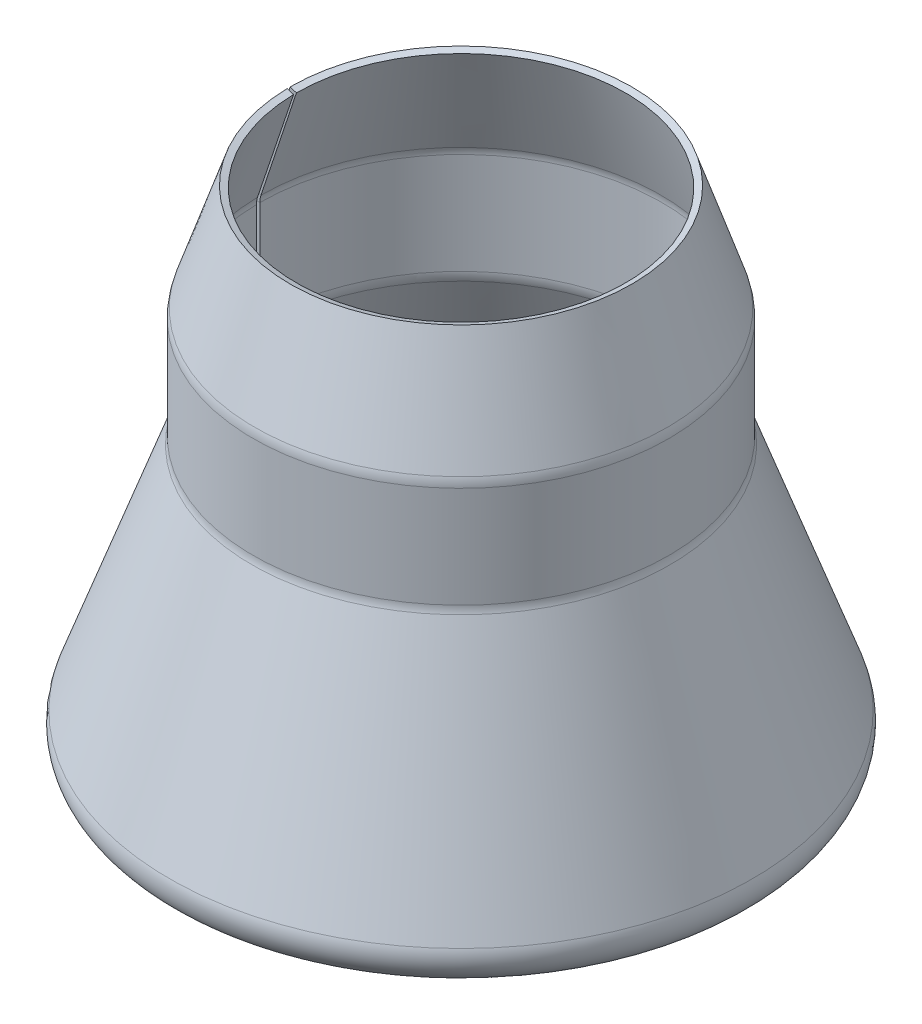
ISO-10303-21;
HEADER;
FILE_DESCRIPTION(('STEP AP214'),'2;1');
FILE_NAME('part.step','',(''),(''),'','','');
FILE_SCHEMA(('AUTOMOTIVE_DESIGN { 1 0 10303 214 1 1 1 1 }'));
ENDSEC;
DATA;
#1=APPLICATION_CONTEXT('core data for automotive mechanical design processes');
#2=APPLICATION_PROTOCOL_DEFINITION('international standard','automotive_design',2000,#1);
#3=PRODUCT_CONTEXT('',#1,'mechanical');
#4=PRODUCT('Part','Part','',(#3));
#5=PRODUCT_RELATED_PRODUCT_CATEGORY('part','',(#4));
#6=PRODUCT_DEFINITION_FORMATION('','',#4);
#7=PRODUCT_DEFINITION_CONTEXT('part definition',#1,'design');
#8=PRODUCT_DEFINITION('design','',#6,#7);
#9=PRODUCT_DEFINITION_SHAPE('','',#8);
#10=(LENGTH_UNIT() NAMED_UNIT(*) SI_UNIT(.MILLI.,.METRE.));
#11=(NAMED_UNIT(*) PLANE_ANGLE_UNIT() SI_UNIT($,.RADIAN.));
#12=(NAMED_UNIT(*) SI_UNIT($,.STERADIAN.) SOLID_ANGLE_UNIT());
#13=UNCERTAINTY_MEASURE_WITH_UNIT(LENGTH_MEASURE(1.E-05),#10,'distance_accuracy_value','');
#14=(GEOMETRIC_REPRESENTATION_CONTEXT(3) GLOBAL_UNCERTAINTY_ASSIGNED_CONTEXT((#13)) GLOBAL_UNIT_ASSIGNED_CONTEXT((#10,
#11,#12)) REPRESENTATION_CONTEXT('',''));
#15=CARTESIAN_POINT('',(0.,0.,0.));
#16=DIRECTION('',(0.,0.,1.));
#17=DIRECTION('',(1.,0.,0.));
#18=AXIS2_PLACEMENT_3D('',#15,#16,#17);
#19=CARTESIAN_POINT('',(-24.4962685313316,49.5131670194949,0.427583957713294));
#20=DIRECTION('',(-0.0174524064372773,0.,-0.999847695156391));
#21=DIRECTION('',(-0.999847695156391,0.,0.0174524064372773));
#22=AXIS2_PLACEMENT_3D('',#19,#20,#21);
#23=PLANE('',#22);
#24=DIRECTION('',(-0.94853880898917,0.316227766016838,0.0165568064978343));
#25=VECTOR('',#24,1.);
#26=CARTESIAN_POINT('',(-27.3418849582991,50.4618503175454,0.477254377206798));
#27=LINE('',#26,#25);
#28=CARTESIAN_POINT('',(-27.3418849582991,50.4618503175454,0.477254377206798));
#29=VERTEX_POINT('',#28);
#30=CARTESIAN_POINT('',(-28.1955698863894,50.7464553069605,0.492155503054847));
#31=VERTEX_POINT('',#30);
#32=EDGE_CURVE('E12',#29,#31,#27,.T.);
#33=ORIENTED_EDGE('',*,*,#32,.F.);
#34=CARTESIAN_POINT('',(-24.4962685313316,49.5131670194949,0.427583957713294));
#35=DIRECTION('',(0.0174524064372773,0.,0.999847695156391));
#36=DIRECTION('',(0.999847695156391,0.,-0.0174524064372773));
#37=AXIS2_PLACEMENT_3D('',#34,#35,#36);
#38=CIRCLE('',#37,3.);
#39=CARTESIAN_POINT('',(-27.4958116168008,49.5131670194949,0.479941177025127));
#40=VERTEX_POINT('',#39);
#41=EDGE_CURVE('E155',#40,#29,#38,.F.);
#42=ORIENTED_EDGE('',*,*,#41,.F.);
#43=DIRECTION('',(-0.999847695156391,0.,0.0174524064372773));
#44=VECTOR('',#43,1.);
#45=CARTESIAN_POINT('',(-27.4958116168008,49.5131670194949,0.479941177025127));
#46=LINE('',#45,#44);
#47=CARTESIAN_POINT('',(-28.3956745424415,49.5131670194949,0.495648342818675));
#48=VERTEX_POINT('',#47);
#49=EDGE_CURVE('E75',#40,#48,#46,.T.);
#50=ORIENTED_EDGE('',*,*,#49,.T.);
#51=CARTESIAN_POINT('',(-24.4962685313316,49.5131670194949,0.427583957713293));
#52=DIRECTION('',(0.0174524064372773,0.,0.999847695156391));
#53=DIRECTION('',(0.999847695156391,0.,-0.0174524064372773));
#54=AXIS2_PLACEMENT_3D('',#51,#52,#53);
#55=CIRCLE('',#54,3.9);
#56=EDGE_CURVE('E152',#48,#31,#55,.F.);
#57=ORIENTED_EDGE('',*,*,#56,.T.);
#58=EDGE_LOOP('',(#33,#42,#50,#57));
#59=FACE_BOUND('',#58,.T.);
#60=ADVANCED_FACE('F66',(#59),#23,.T.);
#61=CARTESIAN_POINT('',(-27.4958116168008,42.5943503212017,0.479941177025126));
#62=DIRECTION('',(0.0174524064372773,0.,0.999847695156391));
#63=DIRECTION('',(0.,1.,0.));
#64=AXIS2_PLACEMENT_3D('',#61,#62,#63);
#65=PLANE('',#64);
#66=ORIENTED_EDGE('',*,*,#49,.F.);
#67=DIRECTION('',(0.,1.,0.));
#68=VECTOR('',#67,1.);
#69=CARTESIAN_POINT('',(-27.4958116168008,35.,0.479941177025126));
#70=LINE('',#69,#68);
#71=CARTESIAN_POINT('',(-27.4958116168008,35.6755336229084,0.479941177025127));
#72=VERTEX_POINT('',#71);
#73=EDGE_CURVE('E231',#72,#40,#70,.T.);
#74=ORIENTED_EDGE('',*,*,#73,.F.);
#75=DIRECTION('',(-0.999847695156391,0.,0.0174524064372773));
#76=VECTOR('',#75,1.);
#77=CARTESIAN_POINT('',(-27.4958116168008,35.6755336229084,0.479941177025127));
#78=LINE('',#77,#76);
#79=CARTESIAN_POINT('',(-28.3956745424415,35.6755336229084,0.495648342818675));
#80=VERTEX_POINT('',#79);
#81=EDGE_CURVE('E160',#72,#80,#78,.T.);
#82=ORIENTED_EDGE('',*,*,#81,.T.);
#83=DIRECTION('',(0.,-1.,0.));
#84=VECTOR('',#83,1.);
#85=CARTESIAN_POINT('',(-28.3956745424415,0.,0.495648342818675));
#86=LINE('',#85,#84);
#87=EDGE_CURVE('E172',#80,#48,#86,.F.);
#88=ORIENTED_EDGE('',*,*,#87,.T.);
#89=EDGE_LOOP('',(#66,#74,#82,#88));
#90=FACE_BOUND('',#89,.T.);
#91=ADVANCED_FACE('F173',(#90),#65,.F.);
#92=CARTESIAN_POINT('',(-31.3952176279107,35.6755336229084,0.548005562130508));
#93=DIRECTION('',(0.0174524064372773,0.,0.999847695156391));
#94=DIRECTION('',(0.999847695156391,0.,-0.0174524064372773));
#95=AXIS2_PLACEMENT_3D('',#92,#93,#94);
#96=PLANE('',#95);
#97=ORIENTED_EDGE('',*,*,#81,.F.);
#98=CARTESIAN_POINT('',(-31.3952176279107,35.6755336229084,0.548005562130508));
#99=DIRECTION('',(-0.0174524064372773,0.,-0.999847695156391));
#100=DIRECTION('',(-0.999847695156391,0.,0.0174524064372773));
#101=AXIS2_PLACEMENT_3D('',#98,#99,#100);
#102=CIRCLE('',#101,3.9);
#103=CARTESIAN_POINT('',(-27.7229835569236,34.3638216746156,0.483906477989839));
#104=VERTEX_POINT('',#103);
#105=EDGE_CURVE('E222',#104,#72,#102,.F.);
#106=ORIENTED_EDGE('',*,*,#105,.F.);
#107=DIRECTION('',(-0.941598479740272,0.336336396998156,0.0164356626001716));
#108=VECTOR('',#107,1.);
#109=CARTESIAN_POINT('',(-27.7229835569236,34.3638216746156,0.483906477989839));
#110=LINE('',#109,#108);
#111=CARTESIAN_POINT('',(-28.5704221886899,34.666524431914,0.498698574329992));
#112=VERTEX_POINT('',#111);
#113=EDGE_CURVE('E263',#104,#112,#110,.T.);
#114=ORIENTED_EDGE('',*,*,#113,.T.);
#115=CARTESIAN_POINT('',(-31.3952176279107,35.6755336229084,0.548005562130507));
#116=DIRECTION('',(0.0174524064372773,0.,0.999847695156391));
#117=DIRECTION('',(0.999847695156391,0.,-0.0174524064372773));
#118=AXIS2_PLACEMENT_3D('',#115,#116,#117);
#119=CIRCLE('',#118,3.);
#120=EDGE_CURVE('E190',#112,#80,#119,.T.);
#121=ORIENTED_EDGE('',*,*,#120,.T.);
#122=EDGE_LOOP('',(#97,#106,#114,#121));
#123=FACE_BOUND('',#122,.T.);
#124=ADVANCED_FACE('F270',(#123),#96,.F.);
#125=CARTESIAN_POINT('',(-27.4958116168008,35.,0.479941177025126));
#126=DIRECTION('',(0.0174524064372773,0.,0.999847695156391));
#127=DIRECTION('',(0.336285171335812,0.941741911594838,-0.00586987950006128));
#128=AXIS2_PLACEMENT_3D('',#125,#126,#127);
#129=PLANE('',#128);
#130=DIRECTION('',(-0.336285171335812,-0.941741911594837,0.00586987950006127));
#131=VECTOR('',#130,1.);
#132=CARTESIAN_POINT('',(-40.8413464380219,0.302702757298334,0.712888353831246));
#133=LINE('',#132,#131);
#134=CARTESIAN_POINT('',(-39.8324909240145,3.12792849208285,0.695278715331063));
#135=VERTEX_POINT('',#134);
#136=EDGE_CURVE('E193',#135,#112,#133,.F.);
#137=ORIENTED_EDGE('',*,*,#136,.T.);
#138=ORIENTED_EDGE('',*,*,#113,.F.);
#139=DIRECTION('',(0.336285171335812,0.941741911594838,-0.00586987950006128));
#140=VECTOR('',#139,1.);
#141=CARTESIAN_POINT('',(-27.4958116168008,35.,0.479941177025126));
#142=LINE('',#141,#140);
#143=CARTESIAN_POINT('',(-38.9850522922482,2.82522573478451,0.680486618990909));
#144=VERTEX_POINT('',#143);
#145=EDGE_CURVE('E216',#144,#104,#142,.T.);
#146=ORIENTED_EDGE('',*,*,#145,.F.);
#147=DIRECTION('',(0.941598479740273,-0.336336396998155,-0.0164356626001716));
#148=VECTOR('',#147,1.);
#149=CARTESIAN_POINT('',(-38.9850522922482,2.82522573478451,0.68048661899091));
#150=LINE('',#149,#148);
#151=EDGE_CURVE('E300',#135,#144,#150,.T.);
#152=ORIENTED_EDGE('',*,*,#151,.F.);
#153=EDGE_LOOP('',(#137,#138,#146,#152));
#154=FACE_BOUND('',#153,.T.);
#155=ADVANCED_FACE('F407',(#154),#129,.F.);
#156=CARTESIAN_POINT('',(-27.5,35.,0.));
#157=DIRECTION('',(0.,0.,1.));
#158=DIRECTION('',(0.336336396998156,0.941741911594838,0.));
#159=AXIS2_PLACEMENT_3D('',#156,#157,#158);
#160=PLANE('',#159);
#161=DIRECTION('',(-0.941741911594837,0.336336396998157,0.));
#162=VECTOR('',#161,1.);
#163=CARTESIAN_POINT('',(-27.7272065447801,34.3638216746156,0.));
#164=LINE('',#163,#162);
#165=CARTESIAN_POINT('',(-27.7272065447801,34.3638216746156,0.));
#166=VERTEX_POINT('',#165);
#167=CARTESIAN_POINT('',(-28.5747742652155,34.666524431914,0.));
#168=VERTEX_POINT('',#167);
#169=EDGE_CURVE('E261',#166,#168,#164,.T.);
#170=ORIENTED_EDGE('',*,*,#169,.T.);
#171=DIRECTION('',(-0.336336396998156,-0.941741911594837,0.));
#172=VECTOR('',#171,1.);
#173=CARTESIAN_POINT('',(-40.8475677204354,0.302702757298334,0.));
#174=LINE('',#173,#172);
#175=CARTESIAN_POINT('',(-39.8385585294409,3.12792849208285,0.));
#176=VERTEX_POINT('',#175);
#177=EDGE_CURVE('E134',#176,#168,#174,.F.);
#178=ORIENTED_EDGE('',*,*,#177,.F.);
#179=DIRECTION('',(0.941741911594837,-0.336336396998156,0.));
#180=VECTOR('',#179,1.);
#181=CARTESIAN_POINT('',(-38.9909908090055,2.82522573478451,0.));
#182=LINE('',#181,#180);
#183=CARTESIAN_POINT('',(-38.9909908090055,2.82522573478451,0.));
#184=VERTEX_POINT('',#183);
#185=EDGE_CURVE('E320',#176,#184,#182,.T.);
#186=ORIENTED_EDGE('',*,*,#185,.T.);
#187=DIRECTION('',(0.336336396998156,0.941741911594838,0.));
#188=VECTOR('',#187,1.);
#189=CARTESIAN_POINT('',(-27.5,35.,0.));
#190=LINE('',#189,#188);
#191=EDGE_CURVE('E212',#184,#166,#190,.T.);
#192=ORIENTED_EDGE('',*,*,#191,.T.);
#193=EDGE_LOOP('',(#170,#178,#186,#192));
#194=FACE_BOUND('',#193,.T.);
#195=ADVANCED_FACE('F410',(#194),#160,.T.);
#196=CARTESIAN_POINT('',(-31.4,35.6755336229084,0.));
#197=DIRECTION('',(0.,0.,1.));
#198=DIRECTION('',(1.,0.,0.));
#199=AXIS2_PLACEMENT_3D('',#196,#197,#198);
#200=PLANE('',#199);
#201=ORIENTED_EDGE('',*,*,#169,.F.);
#202=CARTESIAN_POINT('',(-31.4,35.6755336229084,0.));
#203=DIRECTION('',(0.,0.,-1.));
#204=DIRECTION('',(-1.,0.,0.));
#205=AXIS2_PLACEMENT_3D('',#202,#203,#204);
#206=CIRCLE('',#205,3.9);
#207=CARTESIAN_POINT('',(-27.5,35.6755336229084,0.));
#208=VERTEX_POINT('',#207);
#209=EDGE_CURVE('E214',#166,#208,#206,.F.);
#210=ORIENTED_EDGE('',*,*,#209,.T.);
#211=DIRECTION('',(-1.,0.,0.));
#212=VECTOR('',#211,1.);
#213=CARTESIAN_POINT('',(-27.5,35.6755336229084,0.));
#214=LINE('',#213,#212);
#215=CARTESIAN_POINT('',(-28.4,35.6755336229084,0.));
#216=VERTEX_POINT('',#215);
#217=EDGE_CURVE('E259',#208,#216,#214,.T.);
#218=ORIENTED_EDGE('',*,*,#217,.T.);
#219=CARTESIAN_POINT('',(-31.4,35.6755336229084,0.));
#220=DIRECTION('',(0.,0.,1.));
#221=DIRECTION('',(1.,0.,0.));
#222=AXIS2_PLACEMENT_3D('',#219,#220,#221);
#223=CIRCLE('',#222,3.);
#224=EDGE_CURVE('E204',#168,#216,#223,.T.);
#225=ORIENTED_EDGE('',*,*,#224,.F.);
#226=EDGE_LOOP('',(#201,#210,#218,#225));
#227=FACE_BOUND('',#226,.T.);
#228=ADVANCED_FACE('F413',(#227),#200,.T.);
#229=CARTESIAN_POINT('',(-27.5,42.5943503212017,0.));
#230=DIRECTION('',(0.,0.,1.));
#231=DIRECTION('',(0.,1.,0.));
#232=AXIS2_PLACEMENT_3D('',#229,#230,#231);
#233=PLANE('',#232);
#234=ORIENTED_EDGE('',*,*,#217,.F.);
#235=DIRECTION('',(0.,1.,0.));
#236=VECTOR('',#235,1.);
#237=CARTESIAN_POINT('',(-27.5,35.,0.));
#238=LINE('',#237,#236);
#239=CARTESIAN_POINT('',(-27.5,49.5131670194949,0.));
#240=VERTEX_POINT('',#239);
#241=EDGE_CURVE('E225',#208,#240,#238,.T.);
#242=ORIENTED_EDGE('',*,*,#241,.T.);
#243=DIRECTION('',(-1.,0.,0.));
#244=VECTOR('',#243,1.);
#245=CARTESIAN_POINT('',(-27.5,49.5131670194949,0.));
#246=LINE('',#245,#244);
#247=CARTESIAN_POINT('',(-28.4,49.5131670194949,0.));
#248=VERTEX_POINT('',#247);
#249=EDGE_CURVE('E256',#240,#248,#246,.T.);
#250=ORIENTED_EDGE('',*,*,#249,.T.);
#251=DIRECTION('',(0.,-1.,0.));
#252=VECTOR('',#251,1.);
#253=CARTESIAN_POINT('',(-28.4,0.,0.));
#254=LINE('',#253,#252);
#255=EDGE_CURVE('E182',#216,#248,#254,.F.);
#256=ORIENTED_EDGE('',*,*,#255,.F.);
#257=EDGE_LOOP('',(#234,#242,#250,#256));
#258=FACE_BOUND('',#257,.T.);
#259=ADVANCED_FACE('F369',(#258),#233,.T.);
#260=CARTESIAN_POINT('',(-24.5,49.5131670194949,0.));
#261=DIRECTION('',(0.,0.,-1.));
#262=DIRECTION('',(-1.,0.,0.));
#263=AXIS2_PLACEMENT_3D('',#260,#261,#262);
#264=PLANE('',#263);
#265=ORIENTED_EDGE('',*,*,#249,.F.);
#266=CARTESIAN_POINT('',(-24.5,49.5131670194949,0.));
#267=DIRECTION('',(0.,0.,1.));
#268=DIRECTION('',(1.,0.,0.));
#269=AXIS2_PLACEMENT_3D('',#266,#267,#268);
#270=CIRCLE('',#269,3.);
#271=CARTESIAN_POINT('',(-27.3460498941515,50.4618503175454,0.));
#272=VERTEX_POINT('',#271);
#273=EDGE_CURVE('E234',#240,#272,#270,.F.);
#274=ORIENTED_EDGE('',*,*,#273,.T.);
#275=DIRECTION('',(-0.948683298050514,0.316227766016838,0.));
#276=VECTOR('',#275,1.);
#277=CARTESIAN_POINT('',(-27.3460498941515,50.4618503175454,0.));
#278=LINE('',#277,#276);
#279=CARTESIAN_POINT('',(-28.199864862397,50.7464553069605,0.));
#280=VERTEX_POINT('',#279);
#281=EDGE_CURVE('E253',#272,#280,#278,.T.);
#282=ORIENTED_EDGE('',*,*,#281,.T.);
#283=CARTESIAN_POINT('',(-24.5,49.5131670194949,0.));
#284=DIRECTION('',(0.,0.,1.));
#285=DIRECTION('',(1.,0.,0.));
#286=AXIS2_PLACEMENT_3D('',#283,#284,#285);
#287=CIRCLE('',#286,3.9);
#288=EDGE_CURVE('E201',#248,#280,#287,.F.);
#289=ORIENTED_EDGE('',*,*,#288,.F.);
#290=EDGE_LOOP('',(#265,#274,#282,#289));
#291=FACE_BOUND('',#290,.T.);
#292=ADVANCED_FACE('F373',(#291),#264,.F.);
#293=CARTESIAN_POINT('',(-27.5,50.,0.));
#294=DIRECTION('',(0.,0.,1.));
#295=DIRECTION('',(0.316227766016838,0.948683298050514,0.));
#296=AXIS2_PLACEMENT_3D('',#293,#294,#295);
#297=PLANE('',#296);
#298=ORIENTED_EDGE('',*,*,#281,.F.);
#299=DIRECTION('',(0.316227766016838,0.948683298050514,0.));
#300=VECTOR('',#299,1.);
#301=CARTESIAN_POINT('',(-27.5,50.,0.));
#302=LINE('',#301,#300);
#303=CARTESIAN_POINT('',(-22.5,65.,0.));
#304=VERTEX_POINT('',#303);
#305=EDGE_CURVE('E219',#272,#304,#302,.T.);
#306=ORIENTED_EDGE('',*,*,#305,.T.);
#307=DIRECTION('',(-0.948683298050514,0.316227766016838,0.));
#308=VECTOR('',#307,1.);
#309=CARTESIAN_POINT('',(-22.5,65.,0.));
#310=LINE('',#309,#308);
#311=CARTESIAN_POINT('',(-23.3538149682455,65.2846049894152,0.));
#312=VERTEX_POINT('',#311);
#313=EDGE_CURVE('E250',#304,#312,#310,.T.);
#314=ORIENTED_EDGE('',*,*,#313,.T.);
#315=DIRECTION('',(-0.316227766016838,-0.948683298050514,0.));
#316=VECTOR('',#315,1.);
#317=CARTESIAN_POINT('',(-28.199864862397,50.7464553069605,0.));
#318=LINE('',#317,#316);
#319=EDGE_CURVE('E198',#280,#312,#318,.F.);
#320=ORIENTED_EDGE('',*,*,#319,.F.);
#321=EDGE_LOOP('',(#298,#306,#314,#320));
#322=FACE_BOUND('',#321,.T.);
#323=ADVANCED_FACE('F385',(#322),#297,.T.);
#324=CARTESIAN_POINT('',(0.,65.,0.));
#325=DIRECTION('',(0.,1.,0.));
#326=DIRECTION('',(0.,0.,1.));
#327=AXIS2_PLACEMENT_3D('',#324,#325,#326);
#328=CONICAL_SURFACE('',#327,22.5,1.24904577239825);
#329=ORIENTED_EDGE('',*,*,#313,.F.);
#330=CARTESIAN_POINT('',(0.,65.,0.));
#331=DIRECTION('',(0.,-1.,0.));
#332=DIRECTION('',(-1.,0.,0.));
#333=AXIS2_PLACEMENT_3D('',#330,#331,#332);
#334=CIRCLE('',#333,22.5);
#335=CARTESIAN_POINT('',(-22.4965731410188,65.,0.39267914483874));
#336=VERTEX_POINT('',#335);
#337=EDGE_CURVE('E208',#304,#336,#334,.T.);
#338=ORIENTED_EDGE('',*,*,#337,.T.);
#339=DIRECTION('',(-0.94853880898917,0.316227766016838,0.0165568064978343));
#340=VECTOR('',#339,1.);
#341=CARTESIAN_POINT('',(-22.4965731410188,65.,0.39267914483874));
#342=LINE('',#341,#340);
#343=CARTESIAN_POINT('',(-23.3502580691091,65.2846049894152,0.40758027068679));
#344=VERTEX_POINT('',#343);
#345=EDGE_CURVE('E70',#336,#344,#342,.T.);
#346=ORIENTED_EDGE('',*,*,#345,.T.);
#347=CARTESIAN_POINT('',(0.,65.2846049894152,0.));
#348=DIRECTION('',(0.,-1.,0.));
#349=DIRECTION('',(0.,0.,-1.));
#350=AXIS2_PLACEMENT_3D('',#347,#348,#349);
#351=CIRCLE('',#350,23.3538149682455);
#352=EDGE_CURVE('E194',#312,#344,#351,.T.);
#353=ORIENTED_EDGE('',*,*,#352,.F.);
#354=EDGE_LOOP('',(#329,#338,#346,#353));
#355=FACE_BOUND('',#354,.T.);
#356=ADVANCED_FACE('F390',(#355),#328,.F.);
#357=CARTESIAN_POINT('',(-27.4958116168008,50.,0.479941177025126));
#358=DIRECTION('',(0.0174524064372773,0.,0.999847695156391));
#359=DIRECTION('',(0.31617960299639,0.948683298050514,-0.00551893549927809));
#360=AXIS2_PLACEMENT_3D('',#357,#358,#359);
#361=PLANE('',#360);
#362=DIRECTION('',(0.31617960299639,0.948683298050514,-0.00551893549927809));
#363=VECTOR('',#362,1.);
#364=CARTESIAN_POINT('',(-27.4958116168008,50.,0.479941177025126));
#365=LINE('',#364,#363);
#366=EDGE_CURVE('E245',#29,#336,#365,.T.);
#367=ORIENTED_EDGE('',*,*,#366,.F.);
#368=ORIENTED_EDGE('',*,*,#32,.T.);
#369=DIRECTION('',(-0.31617960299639,-0.948683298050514,0.00551893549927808));
#370=VECTOR('',#369,1.);
#371=CARTESIAN_POINT('',(-28.1955698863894,50.7464553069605,0.492155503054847));
#372=LINE('',#371,#370);
#373=EDGE_CURVE('E197',#31,#344,#372,.F.);
#374=ORIENTED_EDGE('',*,*,#373,.T.);
#375=ORIENTED_EDGE('',*,*,#345,.F.);
#376=EDGE_LOOP('',(#367,#368,#374,#375));
#377=FACE_BOUND('',#376,.T.);
#378=ADVANCED_FACE('F68',(#377),#361,.F.);
#379=CARTESIAN_POINT('',(0.,50.7464553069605,0.));
#380=DIRECTION('',(0.,-1.,0.));
#381=DIRECTION('',(0.,0.,-1.));
#382=AXIS2_PLACEMENT_3D('',#379,#380,#381);
#383=CONICAL_SURFACE('',#382,28.199864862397,0.321750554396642);
#384=ORIENTED_EDGE('',*,*,#352,.T.);
#385=ORIENTED_EDGE('',*,*,#373,.F.);
#386=CARTESIAN_POINT('',(0.,50.7464553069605,0.));
#387=DIRECTION('',(0.,-1.,0.));
#388=DIRECTION('',(0.,0.,-1.));
#389=AXIS2_PLACEMENT_3D('',#386,#387,#388);
#390=CIRCLE('',#389,28.199864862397);
#391=EDGE_CURVE('E169',#280,#31,#390,.T.);
#392=ORIENTED_EDGE('',*,*,#391,.F.);
#393=ORIENTED_EDGE('',*,*,#319,.T.);
#394=EDGE_LOOP('',(#384,#385,#392,#393));
#395=FACE_BOUND('',#394,.T.);
#396=ADVANCED_FACE('F389',(#395),#383,.T.);
#397=CARTESIAN_POINT('',(0.,49.5131670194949,0.));
#398=DIRECTION('',(0.,-1.,0.));
#399=DIRECTION('',(0.,0.,-1.));
#400=AXIS2_PLACEMENT_3D('',#397,#398,#399);
#401=TOROIDAL_SURFACE('',#400,24.5,3.9);
#402=ORIENTED_EDGE('',*,*,#391,.T.);
#403=ORIENTED_EDGE('',*,*,#56,.F.);
#404=CARTESIAN_POINT('',(0.,49.5131670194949,0.));
#405=DIRECTION('',(0.,-1.,0.));
#406=DIRECTION('',(0.,0.,-1.));
#407=AXIS2_PLACEMENT_3D('',#404,#405,#406);
#408=CIRCLE('',#407,28.4);
#409=EDGE_CURVE('E167',#248,#48,#408,.T.);
#410=ORIENTED_EDGE('',*,*,#409,.F.);
#411=ORIENTED_EDGE('',*,*,#288,.T.);
#412=EDGE_LOOP('',(#402,#403,#410,#411));
#413=FACE_BOUND('',#412,.T.);
#414=ADVANCED_FACE('F164',(#413),#401,.T.);
#415=CARTESIAN_POINT('',(0.,0.,0.));
#416=DIRECTION('',(0.,-1.,0.));
#417=DIRECTION('',(0.,0.,-1.));
#418=AXIS2_PLACEMENT_3D('',#415,#416,#417);
#419=CYLINDRICAL_SURFACE('',#418,28.4);
#420=ORIENTED_EDGE('',*,*,#409,.T.);
#421=ORIENTED_EDGE('',*,*,#87,.F.);
#422=CARTESIAN_POINT('',(0.,35.6755336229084,0.));
#423=DIRECTION('',(0.,-1.,0.));
#424=DIRECTION('',(0.,0.,-1.));
#425=AXIS2_PLACEMENT_3D('',#422,#423,#424);
#426=CIRCLE('',#425,28.4);
#427=EDGE_CURVE('E177',#216,#80,#426,.T.);
#428=ORIENTED_EDGE('',*,*,#427,.F.);
#429=ORIENTED_EDGE('',*,*,#255,.T.);
#430=EDGE_LOOP('',(#420,#421,#428,#429));
#431=FACE_BOUND('',#430,.T.);
#432=ADVANCED_FACE('F180',(#431),#419,.T.);
#433=CARTESIAN_POINT('',(0.,35.6755336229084,0.));
#434=DIRECTION('',(0.,-1.,0.));
#435=DIRECTION('',(0.,0.,-1.));
#436=AXIS2_PLACEMENT_3D('',#433,#434,#435);
#437=TOROIDAL_SURFACE('',#436,31.4,3.);
#438=ORIENTED_EDGE('',*,*,#427,.T.);
#439=ORIENTED_EDGE('',*,*,#120,.F.);
#440=CARTESIAN_POINT('',(0.,34.666524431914,0.));
#441=DIRECTION('',(0.,-1.,0.));
#442=DIRECTION('',(0.,0.,-1.));
#443=AXIS2_PLACEMENT_3D('',#440,#441,#442);
#444=CIRCLE('',#443,28.5747742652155);
#445=EDGE_CURVE('E191',#168,#112,#444,.T.);
#446=ORIENTED_EDGE('',*,*,#445,.F.);
#447=ORIENTED_EDGE('',*,*,#224,.T.);
#448=EDGE_LOOP('',(#438,#439,#446,#447));
#449=FACE_BOUND('',#448,.T.);
#450=ADVANCED_FACE('F274',(#449),#437,.F.);
#451=CARTESIAN_POINT('',(0.,0.302702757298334,0.));
#452=DIRECTION('',(0.,-1.,0.));
#453=DIRECTION('',(0.,0.,-1.));
#454=AXIS2_PLACEMENT_3D('',#451,#452,#453);
#455=CONICAL_SURFACE('',#454,40.8475677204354,0.343023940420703);
#456=CARTESIAN_POINT('',(0.,3.12792849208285,0.));
#457=DIRECTION('',(0.,-1.,0.));
#458=DIRECTION('',(0.,0.,-1.));
#459=AXIS2_PLACEMENT_3D('',#456,#457,#458);
#460=CIRCLE('',#459,39.8385585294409);
#461=EDGE_CURVE('E279',#176,#135,#460,.T.);
#462=ORIENTED_EDGE('',*,*,#461,.F.);
#463=ORIENTED_EDGE('',*,*,#177,.T.);
#464=ORIENTED_EDGE('',*,*,#445,.T.);
#465=ORIENTED_EDGE('',*,*,#136,.F.);
#466=EDGE_LOOP('',(#462,#463,#464,#465));
#467=FACE_BOUND('',#466,.T.);
#468=ADVANCED_FACE('F276',(#467),#455,.T.);
#469=CARTESIAN_POINT('',(0.,50.4618503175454,0.));
#470=DIRECTION('',(0.,-1.,0.));
#471=DIRECTION('',(0.,0.,-1.));
#472=AXIS2_PLACEMENT_3D('',#469,#470,#471);
#473=CONICAL_SURFACE('',#472,27.3460498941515,0.321750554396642);
#474=ORIENTED_EDGE('',*,*,#337,.F.);
#475=ORIENTED_EDGE('',*,*,#305,.F.);
#476=CARTESIAN_POINT('',(0.,50.4618503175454,0.));
#477=DIRECTION('',(0.,-1.,0.));
#478=DIRECTION('',(-1.,0.,0.));
#479=AXIS2_PLACEMENT_3D('',#476,#477,#478);
#480=CIRCLE('',#479,27.3460498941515);
#481=EDGE_CURVE('E242',#272,#29,#480,.T.);
#482=ORIENTED_EDGE('',*,*,#481,.T.);
#483=ORIENTED_EDGE('',*,*,#366,.T.);
#484=EDGE_LOOP('',(#474,#475,#482,#483));
#485=FACE_BOUND('',#484,.T.);
#486=ADVANCED_FACE('F383',(#485),#473,.F.);
#487=CARTESIAN_POINT('',(0.,49.5131670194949,0.));
#488=DIRECTION('',(0.,-1.,0.));
#489=DIRECTION('',(0.,0.,-1.));
#490=AXIS2_PLACEMENT_3D('',#487,#488,#489);
#491=TOROIDAL_SURFACE('',#490,24.5,3.);
#492=ORIENTED_EDGE('',*,*,#481,.F.);
#493=ORIENTED_EDGE('',*,*,#273,.F.);
#494=CARTESIAN_POINT('',(0.,49.5131670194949,0.));
#495=DIRECTION('',(0.,-1.,0.));
#496=DIRECTION('',(-1.,0.,0.));
#497=AXIS2_PLACEMENT_3D('',#494,#495,#496);
#498=CIRCLE('',#497,27.5);
#499=EDGE_CURVE('E237',#240,#40,#498,.T.);
#500=ORIENTED_EDGE('',*,*,#499,.T.);
#501=ORIENTED_EDGE('',*,*,#41,.T.);
#502=EDGE_LOOP('',(#492,#493,#500,#501));
#503=FACE_BOUND('',#502,.T.);
#504=ADVANCED_FACE('F379',(#503),#491,.F.);
#505=CARTESIAN_POINT('',(0.,0.,0.));
#506=DIRECTION('',(0.,-1.,0.));
#507=DIRECTION('',(0.,0.,-1.));
#508=AXIS2_PLACEMENT_3D('',#505,#506,#507);
#509=CYLINDRICAL_SURFACE('',#508,27.5);
#510=ORIENTED_EDGE('',*,*,#499,.F.);
#511=ORIENTED_EDGE('',*,*,#241,.F.);
#512=CARTESIAN_POINT('',(0.,35.6755336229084,0.));
#513=DIRECTION('',(0.,-1.,0.));
#514=DIRECTION('',(-1.,0.,0.));
#515=AXIS2_PLACEMENT_3D('',#512,#513,#514);
#516=CIRCLE('',#515,27.5);
#517=EDGE_CURVE('E228',#208,#72,#516,.T.);
#518=ORIENTED_EDGE('',*,*,#517,.T.);
#519=ORIENTED_EDGE('',*,*,#73,.T.);
#520=EDGE_LOOP('',(#510,#511,#518,#519));
#521=FACE_BOUND('',#520,.T.);
#522=ADVANCED_FACE('F376',(#521),#509,.F.);
#523=CARTESIAN_POINT('',(0.,35.6755336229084,0.));
#524=DIRECTION('',(0.,-1.,0.));
#525=DIRECTION('',(0.,0.,-1.));
#526=AXIS2_PLACEMENT_3D('',#523,#524,#525);
#527=TOROIDAL_SURFACE('',#526,31.4,3.9);
#528=ORIENTED_EDGE('',*,*,#517,.F.);
#529=ORIENTED_EDGE('',*,*,#209,.F.);
#530=CARTESIAN_POINT('',(0.,34.3638216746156,0.));
#531=DIRECTION('',(0.,-1.,0.));
#532=DIRECTION('',(-1.,0.,0.));
#533=AXIS2_PLACEMENT_3D('',#530,#531,#532);
#534=CIRCLE('',#533,27.7272065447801);
#535=EDGE_CURVE('E218',#166,#104,#534,.T.);
#536=ORIENTED_EDGE('',*,*,#535,.T.);
#537=ORIENTED_EDGE('',*,*,#105,.T.);
#538=EDGE_LOOP('',(#528,#529,#536,#537));
#539=FACE_BOUND('',#538,.T.);
#540=ADVANCED_FACE('F507',(#539),#527,.T.);
#541=CARTESIAN_POINT('',(0.,0.,0.));
#542=DIRECTION('',(0.,-1.,0.));
#543=DIRECTION('',(0.,0.,-1.));
#544=AXIS2_PLACEMENT_3D('',#541,#542,#543);
#545=CONICAL_SURFACE('',#544,40.,0.343023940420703);
#546=ORIENTED_EDGE('',*,*,#191,.F.);
#547=CARTESIAN_POINT('',(0.,2.82522573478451,0.));
#548=DIRECTION('',(0.,-1.,0.));
#549=DIRECTION('',(-1.,0.,0.));
#550=AXIS2_PLACEMENT_3D('',#547,#548,#549);
#551=CIRCLE('',#550,38.9909908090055);
#552=EDGE_CURVE('E82',#184,#144,#551,.T.);
#553=ORIENTED_EDGE('',*,*,#552,.T.);
#554=ORIENTED_EDGE('',*,*,#145,.T.);
#555=ORIENTED_EDGE('',*,*,#535,.F.);
#556=EDGE_LOOP('',(#546,#553,#554,#555));
#557=FACE_BOUND('',#556,.T.);
#558=ADVANCED_FACE('F517',(#557),#545,.F.);
#559=CARTESIAN_POINT('',(-36.1602568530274,1.81621654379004,0.631179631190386));
#560=DIRECTION('',(0.0174524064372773,0.,0.999847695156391));
#561=DIRECTION('',(0.999847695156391,0.,-0.0174524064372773));
#562=AXIS2_PLACEMENT_3D('',#559,#560,#561);
#563=PLANE('',#562);
#564=DIRECTION('',(0.336285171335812,0.941741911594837,-0.00586987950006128));
#565=VECTOR('',#564,1.);
#566=CARTESIAN_POINT('',(-37.1691123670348,-1.00900919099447,0.648789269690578));
#567=LINE('',#566,#565);
#568=CARTESIAN_POINT('',(-37.4717690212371,-1.85657691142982,0.654072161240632));
#569=VERTEX_POINT('',#568);
#570=CARTESIAN_POINT('',(-37.1691123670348,-1.00900919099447,0.648789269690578));
#571=VERTEX_POINT('',#570);
#572=EDGE_CURVE('E215',#569,#571,#567,.T.);
#573=ORIENTED_EDGE('',*,*,#572,.F.);
#574=CARTESIAN_POINT('',(-36.1602568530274,1.81621654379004,0.631179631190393));
#575=DIRECTION('',(0.0174524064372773,0.,0.999847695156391));
#576=DIRECTION('',(0.999847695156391,0.,-0.0174524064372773));
#577=AXIS2_PLACEMENT_3D('',#574,#575,#576);
#578=CIRCLE('',#577,3.9);
#579=EDGE_CURVE('E289',#135,#569,#578,.T.);
#580=ORIENTED_EDGE('',*,*,#579,.F.);
#581=ORIENTED_EDGE('',*,*,#151,.T.);
#582=CARTESIAN_POINT('',(-36.1602568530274,1.81621654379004,0.631179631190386));
#583=DIRECTION('',(-0.0174524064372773,0.,-0.999847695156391));
#584=DIRECTION('',(-0.999847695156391,0.,0.0174524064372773));
#585=AXIS2_PLACEMENT_3D('',#582,#583,#584);
#586=CIRCLE('',#585,3.);
#587=EDGE_CURVE('E744',#144,#571,#586,.F.);
#588=ORIENTED_EDGE('',*,*,#587,.T.);
#589=EDGE_LOOP('',(#573,#580,#581,#588));
#590=FACE_BOUND('',#589,.T.);
#591=ADVANCED_FACE('F298',(#590),#563,.F.);
#592=CARTESIAN_POINT('',(-36.165765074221,1.81621654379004,0.));
#593=DIRECTION('',(0.,0.,1.));
#594=DIRECTION('',(1.,0.,0.));
#595=AXIS2_PLACEMENT_3D('',#592,#593,#594);
#596=PLANE('',#595);
#597=ORIENTED_EDGE('',*,*,#185,.F.);
#598=CARTESIAN_POINT('',(-36.165765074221,1.81621654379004,0.));
#599=DIRECTION('',(0.,0.,1.));
#600=DIRECTION('',(1.,0.,0.));
#601=AXIS2_PLACEMENT_3D('',#598,#599,#600);
#602=CIRCLE('',#601,3.9);
#603=CARTESIAN_POINT('',(-37.4774770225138,-1.85657691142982,0.));
#604=VERTEX_POINT('',#603);
#605=EDGE_CURVE('E292',#176,#604,#602,.T.);
#606=ORIENTED_EDGE('',*,*,#605,.T.);
#607=DIRECTION('',(0.336336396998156,0.941741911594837,0.));
#608=VECTOR('',#607,1.);
#609=CARTESIAN_POINT('',(-37.1747742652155,-1.00900919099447,0.));
#610=LINE('',#609,#608);
#611=CARTESIAN_POINT('',(-37.1747742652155,-1.00900919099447,0.));
#612=VERTEX_POINT('',#611);
#613=EDGE_CURVE('E316',#604,#612,#610,.T.);
#614=ORIENTED_EDGE('',*,*,#613,.T.);
#615=CARTESIAN_POINT('',(-36.165765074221,1.81621654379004,0.));
#616=DIRECTION('',(0.,0.,-1.));
#617=DIRECTION('',(-1.,0.,0.));
#618=AXIS2_PLACEMENT_3D('',#615,#616,#617);
#619=CIRCLE('',#618,3.);
#620=EDGE_CURVE('E343',#184,#612,#619,.F.);
#621=ORIENTED_EDGE('',*,*,#620,.F.);
#622=EDGE_LOOP('',(#597,#606,#614,#621));
#623=FACE_BOUND('',#622,.T.);
#624=ADVANCED_FACE('F348',(#623),#596,.T.);
#625=CARTESIAN_POINT('',(-40.,0.,0.));
#626=DIRECTION('',(0.,0.,-1.));
#627=DIRECTION('',(0.941741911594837,-0.336336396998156,0.));
#628=AXIS2_PLACEMENT_3D('',#625,#626,#627);
#629=PLANE('',#628);
#630=ORIENTED_EDGE('',*,*,#613,.F.);
#631=DIRECTION('',(-0.941741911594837,0.336336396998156,0.));
#632=VECTOR('',#631,1.);
#633=CARTESIAN_POINT('',(-37.4774770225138,-1.85657691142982,0.));
#634=LINE('',#633,#632);
#635=CARTESIAN_POINT('',(-22.3154322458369,-7.27159290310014,0.));
#636=VERTEX_POINT('',#635);
#637=EDGE_CURVE('E293',#604,#636,#634,.F.);
#638=ORIENTED_EDGE('',*,*,#637,.T.);
#639=DIRECTION('',(0.336336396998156,0.941741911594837,0.));
#640=VECTOR('',#639,1.);
#641=CARTESIAN_POINT('',(-22.0127294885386,-6.42402518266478,0.));
#642=LINE('',#641,#640);
#643=CARTESIAN_POINT('',(-22.0127294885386,-6.42402518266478,0.));
#644=VERTEX_POINT('',#643);
#645=EDGE_CURVE('E313',#636,#644,#642,.T.);
#646=ORIENTED_EDGE('',*,*,#645,.T.);
#647=DIRECTION('',(0.941741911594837,-0.336336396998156,0.));
#648=VECTOR('',#647,1.);
#649=CARTESIAN_POINT('',(-40.,0.,0.));
#650=LINE('',#649,#648);
#651=EDGE_CURVE('E739',#612,#644,#650,.T.);
#652=ORIENTED_EDGE('',*,*,#651,.F.);
#653=EDGE_LOOP('',(#630,#638,#646,#652));
#654=FACE_BOUND('',#653,.T.);
#655=ADVANCED_FACE('F568',(#654),#629,.F.);
#656=CARTESIAN_POINT('',(0.,-6.42402518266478,0.));
#657=DIRECTION('',(0.,-1.,0.));
#658=DIRECTION('',(0.,0.,-1.));
#659=AXIS2_PLACEMENT_3D('',#656,#657,#658);
#660=CONICAL_SURFACE('',#659,22.0127294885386,0.343023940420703);
#661=ORIENTED_EDGE('',*,*,#645,.F.);
#662=CARTESIAN_POINT('',(0.,-7.27159290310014,0.));
#663=DIRECTION('',(0.,1.,0.));
#664=DIRECTION('',(0.,0.,1.));
#665=AXIS2_PLACEMENT_3D('',#662,#663,#664);
#666=CIRCLE('',#665,22.3154322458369);
#667=CARTESIAN_POINT('',(-22.3120334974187,-7.27159290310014,0.389457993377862));
#668=VERTEX_POINT('',#667);
#669=EDGE_CURVE('E312',#636,#668,#666,.F.);
#670=ORIENTED_EDGE('',*,*,#669,.T.);
#671=DIRECTION('',(0.336285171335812,0.941741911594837,-0.00586987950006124));
#672=VECTOR('',#671,1.);
#673=CARTESIAN_POINT('',(-22.0093768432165,-6.42402518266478,0.384175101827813));
#674=LINE('',#673,#672);
#675=CARTESIAN_POINT('',(-22.0093768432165,-6.42402518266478,0.384175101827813));
#676=VERTEX_POINT('',#675);
#677=EDGE_CURVE('E317',#668,#676,#674,.T.);
#678=ORIENTED_EDGE('',*,*,#677,.T.);
#679=CARTESIAN_POINT('',(0.,-6.42402518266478,0.));
#680=DIRECTION('',(0.,-1.,0.));
#681=DIRECTION('',(-1.,0.,0.));
#682=AXIS2_PLACEMENT_3D('',#679,#680,#681);
#683=CIRCLE('',#682,22.0127294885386);
#684=EDGE_CURVE('E325',#644,#676,#683,.T.);
#685=ORIENTED_EDGE('',*,*,#684,.F.);
#686=EDGE_LOOP('',(#661,#670,#678,#685));
#687=FACE_BOUND('',#686,.T.);
#688=ADVANCED_FACE('F578',(#687),#660,.F.);
#689=CARTESIAN_POINT('',(-39.9939078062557,0.,0.698096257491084));
#690=DIRECTION('',(-0.0174524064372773,0.,-0.999847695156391));
#691=DIRECTION('',(0.941598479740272,-0.336336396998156,-0.0164356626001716));
#692=AXIS2_PLACEMENT_3D('',#689,#690,#691);
#693=PLANE('',#692);
#694=DIRECTION('',(-0.941598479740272,0.336336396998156,0.0164356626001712));
#695=VECTOR('',#694,1.);
#696=CARTESIAN_POINT('',(-37.4717690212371,-1.85657691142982,0.654072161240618));
#697=LINE('',#696,#695);
#698=EDGE_CURVE('E306',#569,#668,#697,.F.);
#699=ORIENTED_EDGE('',*,*,#698,.F.);
#700=ORIENTED_EDGE('',*,*,#572,.T.);
#701=DIRECTION('',(0.941598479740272,-0.336336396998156,-0.0164356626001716));
#702=VECTOR('',#701,1.);
#703=CARTESIAN_POINT('',(-39.9939078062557,0.,0.698096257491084));
#704=LINE('',#703,#702);
#705=EDGE_CURVE('E333',#571,#676,#704,.T.);
#706=ORIENTED_EDGE('',*,*,#705,.T.);
#707=ORIENTED_EDGE('',*,*,#677,.F.);
#708=EDGE_LOOP('',(#699,#700,#706,#707));
#709=FACE_BOUND('',#708,.T.);
#710=ADVANCED_FACE('F588',(#709),#693,.T.);
#711=CARTESIAN_POINT('',(0.,-1.00900919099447,0.));
#712=DIRECTION('',(0.,1.,0.));
#713=DIRECTION('',(0.,0.,1.));
#714=AXIS2_PLACEMENT_3D('',#711,#712,#713);
#715=CONICAL_SURFACE('',#714,37.1747742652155,1.22777238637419);
#716=ORIENTED_EDGE('',*,*,#684,.T.);
#717=ORIENTED_EDGE('',*,*,#705,.F.);
#718=CARTESIAN_POINT('',(0.,-1.00900919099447,0.));
#719=DIRECTION('',(0.,-1.,0.));
#720=DIRECTION('',(-1.,0.,0.));
#721=AXIS2_PLACEMENT_3D('',#718,#719,#720);
#722=CIRCLE('',#721,37.1747742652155);
#723=EDGE_CURVE('E338',#612,#571,#722,.T.);
#724=ORIENTED_EDGE('',*,*,#723,.F.);
#725=ORIENTED_EDGE('',*,*,#651,.T.);
#726=EDGE_LOOP('',(#716,#717,#724,#725));
#727=FACE_BOUND('',#726,.T.);
#728=ADVANCED_FACE('F598',(#727),#715,.F.);
#729=CARTESIAN_POINT('',(0.,1.81621654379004,0.));
#730=DIRECTION('',(0.,-1.,0.));
#731=DIRECTION('',(0.,0.,-1.));
#732=AXIS2_PLACEMENT_3D('',#729,#730,#731);
#733=TOROIDAL_SURFACE('',#732,36.165765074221,3.);
#734=ORIENTED_EDGE('',*,*,#723,.T.);
#735=ORIENTED_EDGE('',*,*,#587,.F.);
#736=ORIENTED_EDGE('',*,*,#552,.F.);
#737=ORIENTED_EDGE('',*,*,#620,.T.);
#738=EDGE_LOOP('',(#734,#735,#736,#737));
#739=FACE_BOUND('',#738,.T.);
#740=ADVANCED_FACE('F609',(#739),#733,.F.);
#741=CARTESIAN_POINT('',(0.,-1.85657691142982,0.));
#742=DIRECTION('',(0.,1.,0.));
#743=DIRECTION('',(0.,0.,1.));
#744=AXIS2_PLACEMENT_3D('',#741,#742,#743);
#745=CONICAL_SURFACE('',#744,37.4774770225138,1.22777238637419);
#746=ORIENTED_EDGE('',*,*,#669,.F.);
#747=ORIENTED_EDGE('',*,*,#637,.F.);
#748=CARTESIAN_POINT('',(0.,-1.85657691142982,0.));
#749=DIRECTION('',(0.,-1.,0.));
#750=DIRECTION('',(0.,0.,-1.));
#751=AXIS2_PLACEMENT_3D('',#748,#749,#750);
#752=CIRCLE('',#751,37.4774770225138);
#753=EDGE_CURVE('E304',#604,#569,#752,.T.);
#754=ORIENTED_EDGE('',*,*,#753,.T.);
#755=ORIENTED_EDGE('',*,*,#698,.T.);
#756=EDGE_LOOP('',(#746,#747,#754,#755));
#757=FACE_BOUND('',#756,.T.);
#758=ADVANCED_FACE('F619',(#757),#745,.T.);
#759=CARTESIAN_POINT('',(0.,1.81621654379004,0.));
#760=DIRECTION('',(0.,-1.,0.));
#761=DIRECTION('',(0.,0.,-1.));
#762=AXIS2_PLACEMENT_3D('',#759,#760,#761);
#763=TOROIDAL_SURFACE('',#762,36.165765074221,3.9);
#764=ORIENTED_EDGE('',*,*,#753,.F.);
#765=ORIENTED_EDGE('',*,*,#605,.F.);
#766=ORIENTED_EDGE('',*,*,#461,.T.);
#767=ORIENTED_EDGE('',*,*,#579,.T.);
#768=EDGE_LOOP('',(#764,#765,#766,#767));
#769=FACE_BOUND('',#768,.T.);
#770=ADVANCED_FACE('F287',(#769),#763,.T.);
#771=CLOSED_SHELL('',(#60,#91,#124,#155,#195,#228,#259,#292,#323,#356,#378,#396,#414,#432,#450,
#468,#486,#504,#522,#540,#558,#591,#624,#655,#688,#710,#728,#740,#758,#770));
#772=MANIFOLD_SOLID_BREP('B2',#771);
#773=ADVANCED_BREP_SHAPE_REPRESENTATION('',(#18,#772),#14);
#774=SHAPE_DEFINITION_REPRESENTATION(#9,#773);
ENDSEC;
END-ISO-10303-21;
